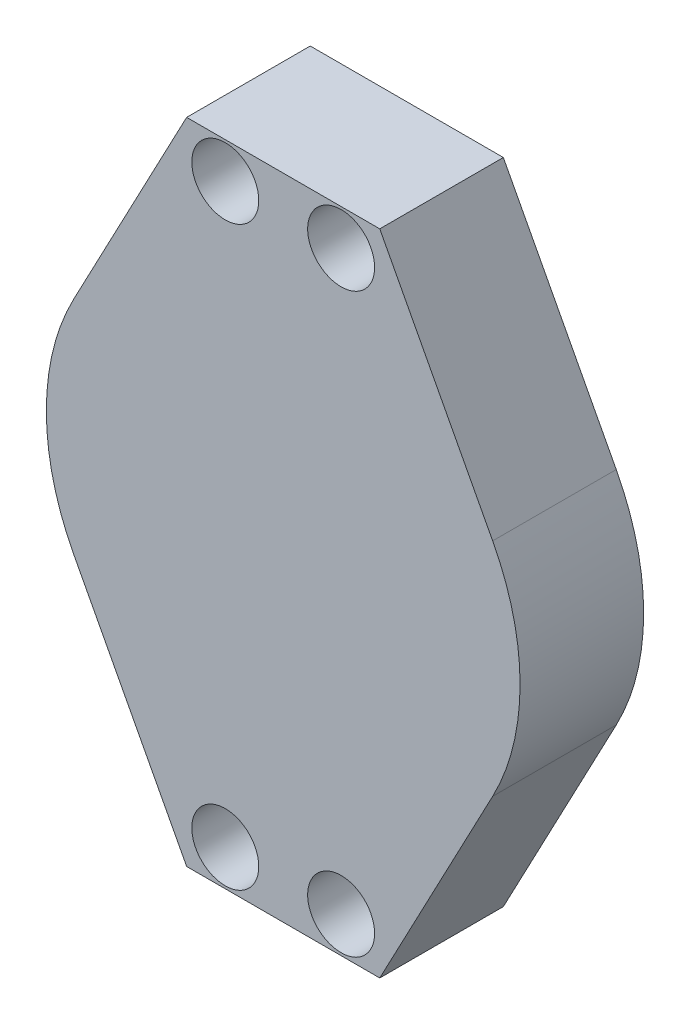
from build123d import *

# Parameters (mm, degrees)
EXTRUSION1_DEPTH                                   = 48
ESQUISSE2_R                                        = 90
ENL_V_MAT_EXTRU_1_DEPTH                            = 32
CHAMBRAGE_POUR_VIS_T_TE_RONDE_BOMB_E_M_D           = 13
CHAMBRAGE_POUR_VIS_T_TE_RONDE_BOMB_E_M_CBORE_D     = 26
CHAMBRAGE_POUR_VIS_T_TE_RONDE_BOMB_E_M_CBORE_DEPTH = 37.5
SYM_TRIE2_COPY_1_D                                 = 13
SYM_TRIE2_COPY_1_CBORE_D                           = 26
SYM_TRIE2_COPY_1_CBORE_DEPTH                       = 37.5


with BuildPart() as part:
    # Esquisse1 → Extrusion1 (new body)
    with BuildSketch(Plane.XY):
        with BuildLine():
            Line((-37.5, 126), (37.5, 126))
            Line((37.5, 126), (81.352427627, 42.962571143))
            ThreePointArc((81.352427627, 42.962571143), (92, 0), (81.352427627, -42.962571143))
            Line((81.352427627, -42.962571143), (37.5, -126))
            Line((37.5, -126), (-37.5, -126))
            Line((-37.5, -126), (-81.352427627, -42.962571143))
            ThreePointArc((-81.352427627, -42.962571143), (-92, 0), (-81.352427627, 42.962571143))
            Line((-81.352427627, 42.962571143), (-37.5, 126))
        make_face()
    extrude(amount=EXTRUSION1_DEPTH)

    # Esquisse2 → Enl_v. mat.-Extru.1 (cut)
    with BuildSketch(Plane(origin=(0, 0, 0), x_dir=(-1, 0, 0), z_dir=(0, 0, -1))):
        Circle(ESQUISSE2_R)
    extrude(amount=-ENL_V_MAT_EXTRU_1_DEPTH, mode=Mode.SUBTRACT)

    # Chambrage pour vis _ t_te ronde bomb_e M (through all)
    with Locations(Plane.XY.offset(48)):
        with Locations((-22.5, 112)):
            chambrage_pour_vis_t_te_ronde_bomb_e_m = CounterBoreHole(CHAMBRAGE_POUR_VIS_T_TE_RONDE_BOMB_E_M_D / 2, CHAMBRAGE_POUR_VIS_T_TE_RONDE_BOMB_E_M_CBORE_D / 2, CHAMBRAGE_POUR_VIS_T_TE_RONDE_BOMB_E_M_CBORE_DEPTH)

    # Sym_trie1: Chambrage pour vis _ t_te ronde bomb_e M across plane
    add(chambrage_pour_vis_t_te_ronde_bomb_e_m.mirror(Plane(origin=(0, 0, 0), x_dir=(0, 0, 1), z_dir=(1, 0, 0))), mode=Mode.SUBTRACT)

    # Sym_trie2: Chambrage pour vis _ t_te ronde bomb_e M across plane
    add(chambrage_pour_vis_t_te_ronde_bomb_e_m.mirror(Plane.ZX), mode=Mode.SUBTRACT)

    # Sym_trie2 copy 1 (through all)
    with Locations(Plane(origin=(0, 0, 48), x_dir=(-1, 0, 0), z_dir=(0, 0, 1))):
        with Locations((-22.5, 112)):
            CounterBoreHole(SYM_TRIE2_COPY_1_D / 2, SYM_TRIE2_COPY_1_CBORE_D / 2, SYM_TRIE2_COPY_1_CBORE_DEPTH)


solid = part.part
